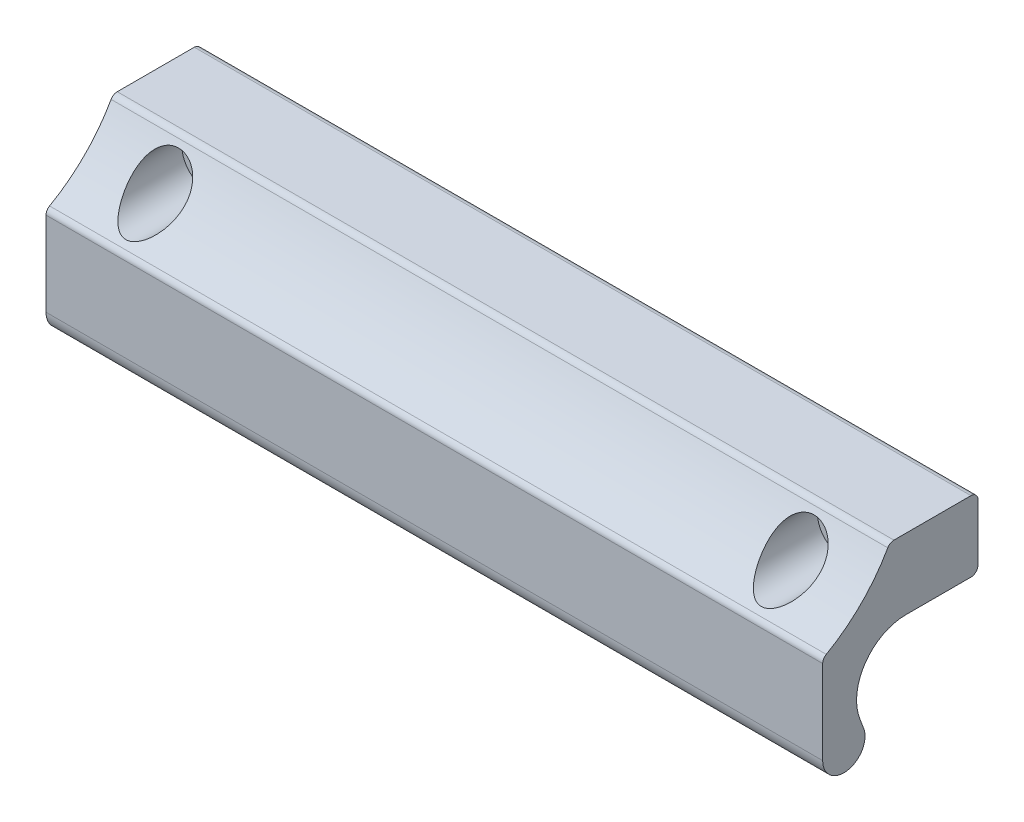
ISO-10303-21;
HEADER;
FILE_DESCRIPTION(('STEP AP214'),'2;1');
FILE_NAME('part.step','',(''),(''),'','','');
FILE_SCHEMA(('AUTOMOTIVE_DESIGN { 1 0 10303 214 1 1 1 1 }'));
ENDSEC;
DATA;
#1=APPLICATION_CONTEXT('core data for automotive mechanical design processes');
#2=APPLICATION_PROTOCOL_DEFINITION('international standard','automotive_design',2000,#1);
#3=PRODUCT_CONTEXT('',#1,'mechanical');
#4=PRODUCT('Part','Part','',(#3));
#5=PRODUCT_RELATED_PRODUCT_CATEGORY('part','',(#4));
#6=PRODUCT_DEFINITION_FORMATION('','',#4);
#7=PRODUCT_DEFINITION_CONTEXT('part definition',#1,'design');
#8=PRODUCT_DEFINITION('design','',#6,#7);
#9=PRODUCT_DEFINITION_SHAPE('','',#8);
#10=(LENGTH_UNIT() NAMED_UNIT(*) SI_UNIT(.MILLI.,.METRE.));
#11=(NAMED_UNIT(*) PLANE_ANGLE_UNIT() SI_UNIT($,.RADIAN.));
#12=(NAMED_UNIT(*) SI_UNIT($,.STERADIAN.) SOLID_ANGLE_UNIT());
#13=UNCERTAINTY_MEASURE_WITH_UNIT(LENGTH_MEASURE(1.E-05),#10,'distance_accuracy_value','');
#14=(GEOMETRIC_REPRESENTATION_CONTEXT(3) GLOBAL_UNCERTAINTY_ASSIGNED_CONTEXT((#13)) GLOBAL_UNIT_ASSIGNED_CONTEXT((#10,
#11,#12)) REPRESENTATION_CONTEXT('',''));
#15=CARTESIAN_POINT('',(0.,0.,0.));
#16=DIRECTION('',(0.,0.,1.));
#17=DIRECTION('',(1.,0.,0.));
#18=AXIS2_PLACEMENT_3D('',#15,#16,#17);
#19=CARTESIAN_POINT('',(-10.,15.8043402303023,32.8043402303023));
#20=DIRECTION('',(1.,0.,0.));
#21=DIRECTION('',(0.,1.,0.));
#22=AXIS2_PLACEMENT_3D('',#19,#20,#21);
#23=CYLINDRICAL_SURFACE('',#22,23.);
#24=CARTESIAN_POINT('',(93.75,0.,16.094378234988));
#25=CARTESIAN_POINT('',(93.7500006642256,-0.150169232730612,16.236409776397));
#26=CARTESIAN_POINT('',(93.7409857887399,-0.29845859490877,16.3805076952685));
#27=CARTESIAN_POINT('',(93.7061827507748,-0.590181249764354,16.6716960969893));
#28=CARTESIAN_POINT('',(93.6803814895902,-0.733610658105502,16.8187888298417));
#29=CARTESIAN_POINT('',(93.6128217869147,-1.01544237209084,17.1155863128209));
#30=CARTESIAN_POINT('',(93.5709823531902,-1.15381519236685,17.2653005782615));
#31=CARTESIAN_POINT('',(93.4720695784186,-1.42405592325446,17.5654707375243));
#32=CARTESIAN_POINT('',(93.4150003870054,-1.55592559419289,17.7159264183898));
#33=CARTESIAN_POINT('',(93.2849647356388,-1.81460439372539,18.0187712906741));
#34=CARTESIAN_POINT('',(93.2117670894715,-1.9413043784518,18.1711545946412));
#35=CARTESIAN_POINT('',(93.0498715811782,-2.1868769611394,18.4741574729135));
#36=CARTESIAN_POINT('',(92.9611662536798,-2.30574575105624,18.6247761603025));
#37=CARTESIAN_POINT('',(92.7681376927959,-2.53420019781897,18.9215160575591));
#38=CARTESIAN_POINT('',(92.6638971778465,-2.64383047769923,19.067656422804));
#39=CARTESIAN_POINT('',(92.4382918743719,-2.853229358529,19.3534526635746));
#40=CARTESIAN_POINT('',(92.316948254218,-2.95300989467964,19.493116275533));
#41=CARTESIAN_POINT('',(92.0789502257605,-3.12374564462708,19.7373761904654));
#42=CARTESIAN_POINT('',(91.965498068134,-3.19663498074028,19.8437139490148));
#43=CARTESIAN_POINT('',(91.7241156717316,-3.33304729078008,20.045999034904));
#44=CARTESIAN_POINT('',(91.5961684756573,-3.39655909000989,20.1419339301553));
#45=CARTESIAN_POINT('',(91.3222714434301,-3.51232726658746,20.3192407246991));
#46=CARTESIAN_POINT('',(91.1760841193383,-3.56440400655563,20.4003772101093));
#47=CARTESIAN_POINT('',(90.9451529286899,-3.62981593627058,20.5033135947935));
#48=CARTESIAN_POINT('',(90.8663403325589,-3.64948596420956,20.5344702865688));
#49=CARTESIAN_POINT('',(90.7051956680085,-3.68401760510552,20.5893923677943));
#50=CARTESIAN_POINT('',(90.6228662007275,-3.69888270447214,20.6131631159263));
#51=CARTESIAN_POINT('',(90.4293848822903,-3.72697994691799,20.658210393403));
#52=CARTESIAN_POINT('',(90.3172035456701,-3.73828046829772,20.6764343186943));
#53=CARTESIAN_POINT('',(90.0908651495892,-3.75060996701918,20.6963234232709));
#54=CARTESIAN_POINT('',(89.9767093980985,-3.75164550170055,20.6979991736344));
#55=CARTESIAN_POINT('',(89.7498794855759,-3.74336926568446,20.6846411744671));
#56=CARTESIAN_POINT('',(89.6372042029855,-3.73406584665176,20.669620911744));
#57=CARTESIAN_POINT('',(89.4161596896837,-3.70595298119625,20.6244737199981));
#58=CARTESIAN_POINT('',(89.307794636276,-3.68713454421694,20.5943325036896));
#59=CARTESIAN_POINT('',(89.0562251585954,-3.6323825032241,20.5072938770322));
#60=CARTESIAN_POINT('',(88.9158969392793,-3.59263719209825,20.4445472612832));
#61=CARTESIAN_POINT('',(88.6486494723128,-3.50092089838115,20.3017774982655));
#62=CARTESIAN_POINT('',(88.5217650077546,-3.44891927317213,20.2217110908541));
#63=CARTESIAN_POINT('',(88.303724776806,-3.34616134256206,20.0659999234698));
#64=CARTESIAN_POINT('',(88.2103375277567,-3.29701024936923,19.9923557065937));
#65=CARTESIAN_POINT('',(88.0314834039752,-3.19345122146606,19.8392926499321));
#66=CARTESIAN_POINT('',(87.946021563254,-3.13903998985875,19.7598701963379));
#67=CARTESIAN_POINT('',(87.7823320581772,-3.0256203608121,19.5966727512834));
#68=CARTESIAN_POINT('',(87.704116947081,-2.96660430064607,19.5128905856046));
#69=CARTESIAN_POINT('',(87.554530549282,-2.84455534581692,19.3421814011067));
#70=CARTESIAN_POINT('',(87.4831614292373,-2.7815211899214,19.255253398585));
#71=CARTESIAN_POINT('',(87.3069800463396,-2.61388606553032,19.0275868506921));
#72=CARTESIAN_POINT('',(87.2070155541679,-2.50653247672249,18.8851063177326));
#73=CARTESIAN_POINT('',(87.022064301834,-2.28371602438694,18.5967547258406));
#74=CARTESIAN_POINT('',(86.9370856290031,-2.16824882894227,18.4508818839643));
#75=CARTESIAN_POINT('',(86.7815301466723,-1.92982538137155,18.1573214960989));
#76=CARTESIAN_POINT('',(86.710967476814,-1.80686192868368,18.0096323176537));
#77=CARTESIAN_POINT('',(86.5842889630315,-1.55415187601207,17.7139267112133));
#78=CARTESIAN_POINT('',(86.5281703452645,-1.42440658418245,17.565910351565));
#79=CARTESIAN_POINT('',(86.4294697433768,-1.15535678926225,17.2669625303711));
#80=CARTESIAN_POINT('',(86.3872582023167,-1.01589497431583,17.116049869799));
#81=CARTESIAN_POINT('',(86.3190319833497,-0.73104439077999,16.8160994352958));
#82=CARTESIAN_POINT('',(86.293019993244,-0.5856546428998,16.667061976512));
#83=CARTESIAN_POINT('',(86.25828003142,-0.290055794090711,16.3722410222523));
#84=CARTESIAN_POINT('',(86.2495221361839,-0.139855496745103,16.2264523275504));
#85=CARTESIAN_POINT('',(86.2505179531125,0.164377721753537,15.9391279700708));
#86=CARTESIAN_POINT('',(86.2602636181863,0.318408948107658,15.7975904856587));
#87=CARTESIAN_POINT('',(86.3079126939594,0.692581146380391,15.4630412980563));
#88=CARTESIAN_POINT('',(86.3557102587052,0.913971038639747,15.2726783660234));
#89=CARTESIAN_POINT('',(86.495799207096,1.35518812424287,14.9073062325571));
#90=CARTESIAN_POINT('',(86.588026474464,1.57501710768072,14.7322753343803));
#91=CARTESIAN_POINT('',(86.7991197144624,1.9636736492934,14.4335970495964));
#92=CARTESIAN_POINT('',(86.909662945,2.13429131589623,14.3064889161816));
#93=CARTESIAN_POINT('',(87.1001727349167,2.3799745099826,14.1282393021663));
#94=CARTESIAN_POINT('',(87.1678322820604,2.46019965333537,14.0708656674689));
#95=CARTESIAN_POINT('',(87.3113580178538,2.61628143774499,13.9606622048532));
#96=CARTESIAN_POINT('',(87.3872204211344,2.69214006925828,13.907830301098));
#97=CARTESIAN_POINT('',(87.5477452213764,2.83917333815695,13.806643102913));
#98=CARTESIAN_POINT('',(87.6324832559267,2.91029755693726,13.758334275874));
#99=CARTESIAN_POINT('',(87.8097619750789,3.04594886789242,13.6672003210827));
#100=CARTESIAN_POINT('',(87.902298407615,3.11047951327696,13.6243722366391));
#101=CARTESIAN_POINT('',(88.0946077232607,3.23185755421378,13.5445905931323));
#102=CARTESIAN_POINT('',(88.1943773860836,3.28870833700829,13.5076344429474));
#103=CARTESIAN_POINT('',(88.4004020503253,3.39369189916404,13.4399472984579));
#104=CARTESIAN_POINT('',(88.5066557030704,3.44182648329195,13.4092150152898));
#105=CARTESIAN_POINT('',(88.7083226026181,3.52193401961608,13.3584049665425));
#106=CARTESIAN_POINT('',(88.8029778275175,3.55524764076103,13.3374209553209));
#107=CARTESIAN_POINT('',(88.9955300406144,3.61437106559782,13.3003439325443));
#108=CARTESIAN_POINT('',(89.0934265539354,3.64018196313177,13.2842502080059));
#109=CARTESIAN_POINT('',(89.2915997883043,3.68387839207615,13.2570880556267));
#110=CARTESIAN_POINT('',(89.3918751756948,3.70176825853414,13.2460168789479));
#111=CARTESIAN_POINT('',(89.5939747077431,3.72934871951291,13.2289770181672));
#112=CARTESIAN_POINT('',(89.6957987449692,3.73903988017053,13.2230079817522));
#113=CARTESIAN_POINT('',(89.8896006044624,3.74949905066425,13.2165676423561));
#114=CARTESIAN_POINT('',(89.9815192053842,3.751079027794,13.2155960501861));
#115=CARTESIAN_POINT('',(90.1652063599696,3.7474856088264,13.2178075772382));
#116=CARTESIAN_POINT('',(90.2569748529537,3.74230994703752,13.2209920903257));
#117=CARTESIAN_POINT('',(90.4395972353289,3.72527248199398,13.2314961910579));
#118=CARTESIAN_POINT('',(90.5304516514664,3.71341478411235,13.2388132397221));
#119=CARTESIAN_POINT('',(90.7106535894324,3.68318293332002,13.2575283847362));
#120=CARTESIAN_POINT('',(90.8000005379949,3.66480635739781,13.2689279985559));
#121=CARTESIAN_POINT('',(91.0615737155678,3.60101108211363,13.3086664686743));
#122=CARTESIAN_POINT('',(91.2308516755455,3.54658365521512,13.3427515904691));
#123=CARTESIAN_POINT('',(91.5568664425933,3.41607587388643,13.4255677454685));
#124=CARTESIAN_POINT('',(91.7136012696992,3.33999210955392,13.4743010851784));
#125=CARTESIAN_POINT('',(92.0192314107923,3.1650856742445,13.5881842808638));
#126=CARTESIAN_POINT('',(92.1672994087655,3.06528886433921,13.6540540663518));
#127=CARTESIAN_POINT('',(92.443829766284,2.84973334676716,13.7992083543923));
#128=CARTESIAN_POINT('',(92.5722875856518,2.73397095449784,13.8784959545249));
#129=CARTESIAN_POINT('',(92.8221710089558,2.47661423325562,14.0586987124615));
#130=CARTESIAN_POINT('',(92.9410681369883,2.33358067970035,14.1610543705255));
#131=CARTESIAN_POINT('',(93.1530779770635,2.03807613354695,14.3781704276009));
#132=CARTESIAN_POINT('',(93.2461621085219,1.88559490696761,14.4929443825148));
#133=CARTESIAN_POINT('',(93.4441188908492,1.50504726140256,14.7873723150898));
#134=CARTESIAN_POINT('',(93.5350714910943,1.27416834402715,14.9727785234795));
#135=CARTESIAN_POINT('',(93.668890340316,0.812200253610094,15.3593785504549));
#136=CARTESIAN_POINT('',(93.7117581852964,0.581111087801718,15.5605718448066));
#137=CARTESIAN_POINT('',(93.7389347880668,0.293978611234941,15.8209607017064));
#138=CARTESIAN_POINT('',(93.7431071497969,0.234797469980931,15.8751995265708));
#139=CARTESIAN_POINT('',(93.7486383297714,0.116983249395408,15.9843147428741));
#140=CARTESIAN_POINT('',(93.7499997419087,0.0583497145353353,16.0391904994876));
#141=CARTESIAN_POINT('',(93.75,0.,16.094378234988));
#142=B_SPLINE_CURVE_WITH_KNOTS('',3,(#24,#25,#26,#27,#28,#29,#30,#31,#32,#33,#34,#35,#36,#37,
#38,#39,#40,#41,#42,#43,#44,#45,#46,#47,#48,#49,#50,#51,#52,#53,#54,#55,#56,#57,#58,#59,#60,#61,
#62,#63,#64,#65,#66,#67,#68,#69,#70,#71,#72,#73,#74,#75,#76,#77,#78,#79,#80,#81,#82,#83,#84,#85,
#86,#87,#88,#89,#90,#91,#92,#93,#94,#95,#96,#97,#98,#99,#100,#101,#102,#103,#104,#105,#106,#107,
#108,#109,#110,#111,#112,#113,#114,#115,#116,#117,#118,#119,#120,#121,#122,#123,#124,#125,#126,
#127,#128,#129,#130,#131,#132,#133,#134,#135,#136,#137,#138,#139,#140,#141),.UNSPECIFIED.,.T.,
.F.,(4,2,2,2,2,2,2,2,2,2,2,2,2,2,2,2,2,2,2,2,2,2,2,2,2,2,2,2,2,2,2,2,2,2,2,2,2,2,2,2,2,2,2,2,2,
2,2,2,2,2,2,2,2,2,2,2,2,2,4),(0.,0.620002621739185,1.24048962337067,1.8641522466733,
2.48764511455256,3.12073548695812,3.75413147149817,4.38426801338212,5.01363137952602,
5.52787354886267,6.04272365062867,6.5651600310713,6.82572511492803,7.08610070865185,
7.4271175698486,7.76791657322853,8.10844048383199,8.44928675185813,8.92293422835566,
9.39777869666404,9.78331644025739,10.1690974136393,10.5555346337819,10.9420937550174,
11.5546950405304,12.1676259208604,12.7811551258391,13.3945664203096,14.0231985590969,
14.6519349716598,15.2795800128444,15.9069521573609,16.7911651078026,17.6741058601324,
18.3902630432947,18.7487042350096,19.1069807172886,19.4686065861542,19.8300365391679,
20.1913065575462,20.5525016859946,20.859631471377,21.166716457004,21.4736331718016,
21.7805286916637,22.056004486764,22.3315726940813,22.606971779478,22.8824733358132,
23.422984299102,23.9635804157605,24.532194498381,25.100940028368,25.7354158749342,
26.370591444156,27.2948858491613,28.2191495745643,28.4602802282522,28.7011882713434),.UNSPECIFIED.);
#143=CARTESIAN_POINT('',(93.75,0.,16.094378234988));
#144=VERTEX_POINT('',#143);
#145=EDGE_CURVE('E18',#144,#144,#142,.T.);
#146=ORIENTED_EDGE('',*,*,#145,.T.);
#147=EDGE_LOOP('',(#146));
#148=FACE_BOUND('',#147,.T.);
#149=CARTESIAN_POINT('',(3.75,0.,16.094378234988));
#150=CARTESIAN_POINT('',(3.75000066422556,-0.150169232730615,16.236409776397));
#151=CARTESIAN_POINT('',(3.74098578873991,-0.298458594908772,16.3805076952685));
#152=CARTESIAN_POINT('',(3.70618275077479,-0.590181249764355,16.6716960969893));
#153=CARTESIAN_POINT('',(3.68038148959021,-0.7336106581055,16.8187888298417));
#154=CARTESIAN_POINT('',(3.61282178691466,-1.01544237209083,17.1155863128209));
#155=CARTESIAN_POINT('',(3.57098235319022,-1.15381519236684,17.2653005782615));
#156=CARTESIAN_POINT('',(3.47206957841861,-1.42405592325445,17.5654707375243));
#157=CARTESIAN_POINT('',(3.41500038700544,-1.55592559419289,17.7159264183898));
#158=CARTESIAN_POINT('',(3.28496473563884,-1.81460439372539,18.0187712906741));
#159=CARTESIAN_POINT('',(3.21176708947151,-1.9413043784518,18.1711545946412));
#160=CARTESIAN_POINT('',(3.04987158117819,-2.1868769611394,18.4741574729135));
#161=CARTESIAN_POINT('',(2.96116625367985,-2.30574575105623,18.6247761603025));
#162=CARTESIAN_POINT('',(2.76813769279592,-2.53420019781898,18.9215160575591));
#163=CARTESIAN_POINT('',(2.66389717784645,-2.64383047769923,19.067656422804));
#164=CARTESIAN_POINT('',(2.43829187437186,-2.853229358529,19.3534526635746));
#165=CARTESIAN_POINT('',(2.31694825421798,-2.95300989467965,19.493116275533));
#166=CARTESIAN_POINT('',(2.07895022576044,-3.12374564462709,19.7373761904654));
#167=CARTESIAN_POINT('',(1.965498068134,-3.19663498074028,19.8437139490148));
#168=CARTESIAN_POINT('',(1.72411567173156,-3.33304729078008,20.045999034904));
#169=CARTESIAN_POINT('',(1.59616847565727,-3.3965590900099,20.1419339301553));
#170=CARTESIAN_POINT('',(1.3222714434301,-3.51232726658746,20.3192407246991));
#171=CARTESIAN_POINT('',(1.17608411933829,-3.56440400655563,20.4003772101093));
#172=CARTESIAN_POINT('',(0.94515292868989,-3.62981593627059,20.5033135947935));
#173=CARTESIAN_POINT('',(0.866340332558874,-3.64948596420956,20.5344702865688));
#174=CARTESIAN_POINT('',(0.705195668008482,-3.68401760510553,20.5893923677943));
#175=CARTESIAN_POINT('',(0.622866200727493,-3.69888270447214,20.6131631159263));
#176=CARTESIAN_POINT('',(0.429384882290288,-3.72697994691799,20.658210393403));
#177=CARTESIAN_POINT('',(0.317203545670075,-3.73828046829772,20.6764343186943));
#178=CARTESIAN_POINT('',(0.0908651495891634,-3.75060996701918,20.6963234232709));
#179=CARTESIAN_POINT('',(-0.0232906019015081,-3.75164550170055,20.6979991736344));
#180=CARTESIAN_POINT('',(-0.250120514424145,-3.74336926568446,20.6846411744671));
#181=CARTESIAN_POINT('',(-0.362795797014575,-3.73406584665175,20.669620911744));
#182=CARTESIAN_POINT('',(-0.583840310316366,-3.70595298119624,20.6244737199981));
#183=CARTESIAN_POINT('',(-0.692205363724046,-3.68713454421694,20.5943325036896));
#184=CARTESIAN_POINT('',(-0.943774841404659,-3.63238250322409,20.5072938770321));
#185=CARTESIAN_POINT('',(-1.08410306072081,-3.59263719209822,20.4445472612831));
#186=CARTESIAN_POINT('',(-1.35135052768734,-3.50092089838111,20.3017774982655));
#187=CARTESIAN_POINT('',(-1.4782349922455,-3.44891927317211,20.221711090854));
#188=CARTESIAN_POINT('',(-1.69627522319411,-3.34616134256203,20.0659999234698));
#189=CARTESIAN_POINT('',(-1.78966247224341,-3.29701024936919,19.9923557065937));
#190=CARTESIAN_POINT('',(-1.9685165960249,-3.19345122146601,19.839292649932));
#191=CARTESIAN_POINT('',(-2.0539784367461,-3.13903998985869,19.7598701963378));
#192=CARTESIAN_POINT('',(-2.2176679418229,-3.02562036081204,19.5966727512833));
#193=CARTESIAN_POINT('',(-2.29588305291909,-2.96660430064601,19.5128905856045));
#194=CARTESIAN_POINT('',(-2.44546945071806,-2.84455534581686,19.3421814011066));
#195=CARTESIAN_POINT('',(-2.51683857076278,-2.78152118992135,19.255253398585));
#196=CARTESIAN_POINT('',(-2.69301995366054,-2.61388606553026,19.0275868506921));
#197=CARTESIAN_POINT('',(-2.79298444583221,-2.50653247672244,18.8851063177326));
#198=CARTESIAN_POINT('',(-2.97793569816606,-2.28371602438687,18.5967547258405));
#199=CARTESIAN_POINT('',(-3.06291437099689,-2.1682488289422,18.4508818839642));
#200=CARTESIAN_POINT('',(-3.21846985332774,-1.92982538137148,18.1573214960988));
#201=CARTESIAN_POINT('',(-3.28903252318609,-1.80686192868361,18.0096323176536));
#202=CARTESIAN_POINT('',(-3.41571103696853,-1.55415187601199,17.7139267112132));
#203=CARTESIAN_POINT('',(-3.47182965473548,-1.42440658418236,17.5659103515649));
#204=CARTESIAN_POINT('',(-3.57053025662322,-1.15535678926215,17.266962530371));
#205=CARTESIAN_POINT('',(-3.61274179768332,-1.01589497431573,17.1160498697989));
#206=CARTESIAN_POINT('',(-3.68096801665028,-0.731044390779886,16.8160994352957));
#207=CARTESIAN_POINT('',(-3.70698000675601,-0.585654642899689,16.6670619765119));
#208=CARTESIAN_POINT('',(-3.74171996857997,-0.290055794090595,16.3722410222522));
#209=CARTESIAN_POINT('',(-3.75047786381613,-0.139855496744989,16.2264523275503));
#210=CARTESIAN_POINT('',(-3.74948204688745,0.164377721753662,15.9391279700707));
#211=CARTESIAN_POINT('',(-3.73973638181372,0.318408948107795,15.7975904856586));
#212=CARTESIAN_POINT('',(-3.69208730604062,0.692581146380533,15.4630412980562));
#213=CARTESIAN_POINT('',(-3.64428974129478,0.913971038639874,15.2726783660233));
#214=CARTESIAN_POINT('',(-3.50420079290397,1.35518812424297,14.907306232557));
#215=CARTESIAN_POINT('',(-3.41197352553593,1.57501710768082,14.7322753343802));
#216=CARTESIAN_POINT('',(-3.20088028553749,1.9636736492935,14.4335970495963));
#217=CARTESIAN_POINT('',(-3.09033705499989,2.13429131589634,14.3064889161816));
#218=CARTESIAN_POINT('',(-2.89982726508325,2.3799745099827,14.1282393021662));
#219=CARTESIAN_POINT('',(-2.83216771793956,2.46019965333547,14.0708656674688));
#220=CARTESIAN_POINT('',(-2.68864198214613,2.61628143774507,13.9606622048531));
#221=CARTESIAN_POINT('',(-2.61277957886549,2.69214006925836,13.9078303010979));
#222=CARTESIAN_POINT('',(-2.45225477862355,2.83917333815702,13.806643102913));
#223=CARTESIAN_POINT('',(-2.36751674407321,2.91029755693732,13.758334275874));
#224=CARTESIAN_POINT('',(-2.19023802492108,3.04594886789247,13.6672003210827));
#225=CARTESIAN_POINT('',(-2.09770159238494,3.11047951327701,13.624372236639));
#226=CARTESIAN_POINT('',(-1.90539227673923,3.23185755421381,13.5445905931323));
#227=CARTESIAN_POINT('',(-1.80562261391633,3.28870833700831,13.5076344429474));
#228=CARTESIAN_POINT('',(-1.59959794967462,3.39369189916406,13.4399472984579));
#229=CARTESIAN_POINT('',(-1.49334429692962,3.44182648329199,13.4092150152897));
#230=CARTESIAN_POINT('',(-1.29167739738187,3.52193401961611,13.3584049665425));
#231=CARTESIAN_POINT('',(-1.19702217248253,3.55524764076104,13.3374209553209));
#232=CARTESIAN_POINT('',(-1.00446995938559,3.61437106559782,13.3003439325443));
#233=CARTESIAN_POINT('',(-0.906573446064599,3.64018196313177,13.2842502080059));
#234=CARTESIAN_POINT('',(-0.708400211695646,3.68387839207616,13.2570880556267));
#235=CARTESIAN_POINT('',(-0.608124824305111,3.70176825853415,13.2460168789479));
#236=CARTESIAN_POINT('',(-0.406025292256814,3.72934871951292,13.2289770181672));
#237=CARTESIAN_POINT('',(-0.304201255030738,3.73903988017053,13.2230079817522));
#238=CARTESIAN_POINT('',(-0.110399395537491,3.74949905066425,13.2165676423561));
#239=CARTESIAN_POINT('',(-0.0184807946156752,3.751079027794,13.2155960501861));
#240=CARTESIAN_POINT('',(0.165206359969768,3.7474856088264,13.2178075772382));
#241=CARTESIAN_POINT('',(0.256974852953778,3.74230994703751,13.2209920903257));
#242=CARTESIAN_POINT('',(0.439597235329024,3.72527248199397,13.2314961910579));
#243=CARTESIAN_POINT('',(0.530451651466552,3.71341478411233,13.2388132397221));
#244=CARTESIAN_POINT('',(0.710653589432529,3.68318293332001,13.2575283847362));
#245=CARTESIAN_POINT('',(0.800000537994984,3.66480635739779,13.2689279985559));
#246=CARTESIAN_POINT('',(1.06157371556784,3.60101108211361,13.3086664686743));
#247=CARTESIAN_POINT('',(1.23085167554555,3.54658365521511,13.3427515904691));
#248=CARTESIAN_POINT('',(1.55686644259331,3.4160758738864,13.4255677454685));
#249=CARTESIAN_POINT('',(1.71360126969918,3.33999210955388,13.4743010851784));
#250=CARTESIAN_POINT('',(2.01923141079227,3.16508567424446,13.5881842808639));
#251=CARTESIAN_POINT('',(2.1672994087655,3.06528886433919,13.6540540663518));
#252=CARTESIAN_POINT('',(2.44382976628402,2.84973334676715,13.7992083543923));
#253=CARTESIAN_POINT('',(2.5722875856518,2.7339709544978,13.878495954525));
#254=CARTESIAN_POINT('',(2.82217100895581,2.47661423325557,14.0586987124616));
#255=CARTESIAN_POINT('',(2.94106813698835,2.3335806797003,14.1610543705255));
#256=CARTESIAN_POINT('',(3.15307797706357,2.03807613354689,14.378170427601));
#257=CARTESIAN_POINT('',(3.24616210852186,1.88559490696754,14.4929443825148));
#258=CARTESIAN_POINT('',(3.44411889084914,1.50504726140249,14.7873723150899));
#259=CARTESIAN_POINT('',(3.53507149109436,1.27416834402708,14.9727785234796));
#260=CARTESIAN_POINT('',(3.66889034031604,0.812200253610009,15.3593785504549));
#261=CARTESIAN_POINT('',(3.71175818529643,0.581111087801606,15.5605718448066));
#262=CARTESIAN_POINT('',(3.73893478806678,0.293978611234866,15.8209607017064));
#263=CARTESIAN_POINT('',(3.74310714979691,0.234797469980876,15.8751995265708));
#264=CARTESIAN_POINT('',(3.74863832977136,0.116983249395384,15.9843147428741));
#265=CARTESIAN_POINT('',(3.7499997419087,0.0583497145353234,16.0391904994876));
#266=CARTESIAN_POINT('',(3.75,0.,16.094378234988));
#267=B_SPLINE_CURVE_WITH_KNOTS('',3,(#149,#150,#151,#152,#153,#154,#155,#156,#157,#158,#159,
#160,#161,#162,#163,#164,#165,#166,#167,#168,#169,#170,#171,#172,#173,#174,#175,#176,#177,#178,
#179,#180,#181,#182,#183,#184,#185,#186,#187,#188,#189,#190,#191,#192,#193,#194,#195,#196,#197,
#198,#199,#200,#201,#202,#203,#204,#205,#206,#207,#208,#209,#210,#211,#212,#213,#214,#215,#216,
#217,#218,#219,#220,#221,#222,#223,#224,#225,#226,#227,#228,#229,#230,#231,#232,#233,#234,#235,
#236,#237,#238,#239,#240,#241,#242,#243,#244,#245,#246,#247,#248,#249,#250,#251,#252,#253,#254,
#255,#256,#257,#258,#259,#260,#261,#262,#263,#264,#265,#266),.UNSPECIFIED.,.T.,.F.,(4,2,2,2,2,2,
2,2,2,2,2,2,2,2,2,2,2,2,2,2,2,2,2,2,2,2,2,2,2,2,2,2,2,2,2,2,2,2,2,2,2,2,2,2,2,2,2,2,2,2,2,2,2,2,
2,2,2,2,4),(0.,0.620002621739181,1.24048962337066,1.8641522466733,2.48764511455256,
3.12073548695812,3.75413147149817,4.38426801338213,5.01363137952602,5.52787354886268,
6.04272365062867,6.5651600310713,6.82572511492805,7.08610070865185,7.42711756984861,
7.76791657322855,8.10844048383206,8.44928675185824,8.92293422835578,9.39777869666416,
9.78331644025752,10.1690974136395,10.555534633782,10.9420937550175,11.5546950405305,
12.1676259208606,12.7811551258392,13.3945664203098,14.0231985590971,14.65193497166,
15.2795800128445,15.9069521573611,16.7911651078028,17.6741058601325,18.3902630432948,
18.7487042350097,19.1069807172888,19.4686065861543,19.830036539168,20.1913065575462,
20.5525016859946,20.859631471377,21.1667164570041,21.4736331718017,21.7805286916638,
22.0560044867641,22.3315726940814,22.6069717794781,22.8824733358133,23.422984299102,
23.9635804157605,24.532194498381,25.1009400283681,25.7354158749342,26.3705914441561,
27.2948858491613,28.2191495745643,28.4602802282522,28.7011882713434),.UNSPECIFIED.);
#268=CARTESIAN_POINT('',(3.75,0.,16.094378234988));
#269=VERTEX_POINT('',#268);
#270=EDGE_CURVE('E131',#269,#269,#267,.T.);
#271=ORIENTED_EDGE('',*,*,#270,.T.);
#272=EDGE_LOOP('',(#271));
#273=FACE_BOUND('',#272,.T.);
#274=DIRECTION('',(1.,0.,0.));
#275=VECTOR('',#274,1.);
#276=CARTESIAN_POINT('',(-10.,-4.22133100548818,21.4918475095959));
#277=LINE('',#276,#275);
#278=CARTESIAN_POINT('',(-10.,-4.22133100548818,21.4918475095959));
#279=VERTEX_POINT('',#278);
#280=CARTESIAN_POINT('',(100.,-4.22133100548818,21.4918475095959));
#281=VERTEX_POINT('',#280);
#282=EDGE_CURVE('E127',#279,#281,#277,.T.);
#283=ORIENTED_EDGE('',*,*,#282,.T.);
#284=CARTESIAN_POINT('',(100.,15.8043402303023,32.8043402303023));
#285=DIRECTION('',(1.,0.,0.));
#286=DIRECTION('',(0.,-1.,0.));
#287=AXIS2_PLACEMENT_3D('',#284,#285,#286);
#288=CIRCLE('',#287,23.);
#289=CARTESIAN_POINT('',(100.,4.49184750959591,12.7786689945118));
#290=VERTEX_POINT('',#289);
#291=EDGE_CURVE('E121',#281,#290,#288,.T.);
#292=ORIENTED_EDGE('',*,*,#291,.T.);
#293=DIRECTION('',(1.,0.,0.));
#294=VECTOR('',#293,1.);
#295=CARTESIAN_POINT('',(-10.,4.49184750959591,12.7786689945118));
#296=LINE('',#295,#294);
#297=CARTESIAN_POINT('',(-10.,4.49184750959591,12.7786689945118));
#298=VERTEX_POINT('',#297);
#299=EDGE_CURVE('E9',#298,#290,#296,.T.);
#300=ORIENTED_EDGE('',*,*,#299,.F.);
#301=CARTESIAN_POINT('',(-10.,15.8043402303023,32.8043402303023));
#302=DIRECTION('',(1.,0.,0.));
#303=DIRECTION('',(0.,-1.,0.));
#304=AXIS2_PLACEMENT_3D('',#301,#302,#303);
#305=CIRCLE('',#304,23.);
#306=EDGE_CURVE('E162',#279,#298,#305,.T.);
#307=ORIENTED_EDGE('',*,*,#306,.F.);
#308=EDGE_LOOP('',(#283,#292,#300,#307));
#309=FACE_BOUND('',#308,.T.);
#310=ADVANCED_FACE('F14',(#148,#273,#309),#23,.F.);
#311=CARTESIAN_POINT('',(-10.,4.,11.907987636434));
#312=DIRECTION('',(1.,0.,0.));
#313=DIRECTION('',(0.,1.,0.));
#314=AXIS2_PLACEMENT_3D('',#311,#312,#313);
#315=CYLINDRICAL_SURFACE('',#314,1.);
#316=ORIENTED_EDGE('',*,*,#299,.T.);
#317=CARTESIAN_POINT('',(100.,4.,11.907987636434));
#318=DIRECTION('',(-1.,0.,0.));
#319=DIRECTION('',(0.,-1.,0.));
#320=AXIS2_PLACEMENT_3D('',#317,#318,#319);
#321=CIRCLE('',#320,1.);
#322=CARTESIAN_POINT('',(100.,5.,11.907987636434));
#323=VERTEX_POINT('',#322);
#324=EDGE_CURVE('E111',#290,#323,#321,.T.);
#325=ORIENTED_EDGE('',*,*,#324,.T.);
#326=DIRECTION('',(1.,0.,0.));
#327=VECTOR('',#326,1.);
#328=CARTESIAN_POINT('',(-10.,5.,11.907987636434));
#329=LINE('',#328,#327);
#330=CARTESIAN_POINT('',(-10.,5.,11.907987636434));
#331=VERTEX_POINT('',#330);
#332=EDGE_CURVE('E27',#331,#323,#329,.T.);
#333=ORIENTED_EDGE('',*,*,#332,.F.);
#334=CARTESIAN_POINT('',(-10.,4.,11.907987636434));
#335=DIRECTION('',(-1.,0.,0.));
#336=DIRECTION('',(0.,-1.,0.));
#337=AXIS2_PLACEMENT_3D('',#334,#335,#336);
#338=CIRCLE('',#337,1.);
#339=EDGE_CURVE('E112',#298,#331,#338,.T.);
#340=ORIENTED_EDGE('',*,*,#339,.F.);
#341=EDGE_LOOP('',(#316,#325,#333,#340));
#342=FACE_BOUND('',#341,.T.);
#343=ADVANCED_FACE('F109',(#342),#315,.T.);
#344=CARTESIAN_POINT('',(-10.,5.,11.907987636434));
#345=DIRECTION('',(0.,-1.,0.));
#346=DIRECTION('',(1.,0.,0.));
#347=AXIS2_PLACEMENT_3D('',#344,#345,#346);
#348=PLANE('',#347);
#349=ORIENTED_EDGE('',*,*,#332,.T.);
#350=DIRECTION('',(0.,0.,-1.));
#351=VECTOR('',#350,1.);
#352=CARTESIAN_POINT('',(100.,5.,11.907987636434));
#353=LINE('',#352,#351);
#354=CARTESIAN_POINT('',(100.,5.,1.));
#355=VERTEX_POINT('',#354);
#356=EDGE_CURVE('E125',#323,#355,#353,.T.);
#357=ORIENTED_EDGE('',*,*,#356,.T.);
#358=DIRECTION('',(1.,0.,0.));
#359=VECTOR('',#358,1.);
#360=CARTESIAN_POINT('',(-10.,5.,1.));
#361=LINE('',#360,#359);
#362=CARTESIAN_POINT('',(-10.,5.,1.));
#363=VERTEX_POINT('',#362);
#364=EDGE_CURVE('E200',#363,#355,#361,.T.);
#365=ORIENTED_EDGE('',*,*,#364,.F.);
#366=DIRECTION('',(0.,0.,-1.));
#367=VECTOR('',#366,1.);
#368=CARTESIAN_POINT('',(-10.,5.,11.907987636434));
#369=LINE('',#368,#367);
#370=EDGE_CURVE('E165',#331,#363,#369,.T.);
#371=ORIENTED_EDGE('',*,*,#370,.F.);
#372=EDGE_LOOP('',(#349,#357,#365,#371));
#373=FACE_BOUND('',#372,.T.);
#374=ADVANCED_FACE('F265',(#373),#348,.F.);
#375=CARTESIAN_POINT('',(-10.,4.,1.));
#376=DIRECTION('',(1.,0.,0.));
#377=DIRECTION('',(0.,1.,0.));
#378=AXIS2_PLACEMENT_3D('',#375,#376,#377);
#379=CYLINDRICAL_SURFACE('',#378,1.);
#380=ORIENTED_EDGE('',*,*,#364,.T.);
#381=CARTESIAN_POINT('',(100.,4.,1.));
#382=DIRECTION('',(-1.,0.,0.));
#383=DIRECTION('',(0.,-1.,0.));
#384=AXIS2_PLACEMENT_3D('',#381,#382,#383);
#385=CIRCLE('',#384,1.);
#386=CARTESIAN_POINT('',(100.,4.,0.));
#387=VERTEX_POINT('',#386);
#388=EDGE_CURVE('E136',#355,#387,#385,.T.);
#389=ORIENTED_EDGE('',*,*,#388,.T.);
#390=DIRECTION('',(1.,0.,0.));
#391=VECTOR('',#390,1.);
#392=CARTESIAN_POINT('',(-10.,4.,0.));
#393=LINE('',#392,#391);
#394=CARTESIAN_POINT('',(-10.,4.,0.));
#395=VERTEX_POINT('',#394);
#396=EDGE_CURVE('E198',#395,#387,#393,.T.);
#397=ORIENTED_EDGE('',*,*,#396,.F.);
#398=CARTESIAN_POINT('',(-10.,4.,1.));
#399=DIRECTION('',(-1.,0.,0.));
#400=DIRECTION('',(0.,-1.,0.));
#401=AXIS2_PLACEMENT_3D('',#398,#399,#400);
#402=CIRCLE('',#401,1.);
#403=EDGE_CURVE('E167',#363,#395,#402,.T.);
#404=ORIENTED_EDGE('',*,*,#403,.F.);
#405=EDGE_LOOP('',(#380,#389,#397,#404));
#406=FACE_BOUND('',#405,.T.);
#407=ADVANCED_FACE('F261',(#406),#379,.T.);
#408=CARTESIAN_POINT('',(-10.,4.,0.));
#409=DIRECTION('',(0.,0.,1.));
#410=DIRECTION('',(-1.,0.,0.));
#411=AXIS2_PLACEMENT_3D('',#408,#409,#410);
#412=PLANE('',#411);
#413=CARTESIAN_POINT('',(90.,0.,0.));
#414=DIRECTION('',(0.,0.,-1.));
#415=DIRECTION('',(1.,0.,0.));
#416=AXIS2_PLACEMENT_3D('',#413,#414,#415);
#417=CIRCLE('',#416,2.25);
#418=CARTESIAN_POINT('',(92.25,0.,0.));
#419=VERTEX_POINT('',#418);
#420=EDGE_CURVE('E285',#419,#419,#417,.T.);
#421=ORIENTED_EDGE('',*,*,#420,.F.);
#422=EDGE_LOOP('',(#421));
#423=FACE_BOUND('',#422,.T.);
#424=CARTESIAN_POINT('',(0.,0.,0.));
#425=DIRECTION('',(0.,0.,-1.));
#426=DIRECTION('',(1.,0.,0.));
#427=AXIS2_PLACEMENT_3D('',#424,#425,#426);
#428=CIRCLE('',#427,2.25);
#429=CARTESIAN_POINT('',(2.25,0.,0.));
#430=VERTEX_POINT('',#429);
#431=EDGE_CURVE('E128',#430,#430,#428,.T.);
#432=ORIENTED_EDGE('',*,*,#431,.F.);
#433=EDGE_LOOP('',(#432));
#434=FACE_BOUND('',#433,.T.);
#435=ORIENTED_EDGE('',*,*,#396,.T.);
#436=DIRECTION('',(0.,-1.,0.));
#437=VECTOR('',#436,1.);
#438=CARTESIAN_POINT('',(100.,4.,0.));
#439=LINE('',#438,#437);
#440=CARTESIAN_POINT('',(100.,-4.,0.));
#441=VERTEX_POINT('',#440);
#442=EDGE_CURVE('E139',#387,#441,#439,.T.);
#443=ORIENTED_EDGE('',*,*,#442,.T.);
#444=DIRECTION('',(1.,0.,0.));
#445=VECTOR('',#444,1.);
#446=CARTESIAN_POINT('',(-10.,-4.,0.));
#447=LINE('',#446,#445);
#448=CARTESIAN_POINT('',(-10.,-4.,0.));
#449=VERTEX_POINT('',#448);
#450=EDGE_CURVE('E196',#449,#441,#447,.T.);
#451=ORIENTED_EDGE('',*,*,#450,.F.);
#452=DIRECTION('',(0.,-1.,0.));
#453=VECTOR('',#452,1.);
#454=CARTESIAN_POINT('',(-10.,4.,0.));
#455=LINE('',#454,#453);
#456=EDGE_CURVE('E169',#395,#449,#455,.T.);
#457=ORIENTED_EDGE('',*,*,#456,.F.);
#458=EDGE_LOOP('',(#435,#443,#451,#457));
#459=FACE_BOUND('',#458,.T.);
#460=ADVANCED_FACE('F257',(#423,#434,#459),#412,.F.);
#461=CARTESIAN_POINT('',(-10.,-4.,1.));
#462=DIRECTION('',(1.,0.,0.));
#463=DIRECTION('',(0.,1.,0.));
#464=AXIS2_PLACEMENT_3D('',#461,#462,#463);
#465=CYLINDRICAL_SURFACE('',#464,1.);
#466=ORIENTED_EDGE('',*,*,#450,.T.);
#467=CARTESIAN_POINT('',(100.,-4.,1.));
#468=DIRECTION('',(-1.,0.,0.));
#469=DIRECTION('',(0.,-1.,0.));
#470=AXIS2_PLACEMENT_3D('',#467,#468,#469);
#471=CIRCLE('',#470,1.);
#472=CARTESIAN_POINT('',(100.,-5.,1.));
#473=VERTEX_POINT('',#472);
#474=EDGE_CURVE('E142',#441,#473,#471,.T.);
#475=ORIENTED_EDGE('',*,*,#474,.T.);
#476=DIRECTION('',(1.,0.,0.));
#477=VECTOR('',#476,1.);
#478=CARTESIAN_POINT('',(-10.,-5.,1.));
#479=LINE('',#478,#477);
#480=CARTESIAN_POINT('',(-10.,-5.,1.));
#481=VERTEX_POINT('',#480);
#482=EDGE_CURVE('E194',#481,#473,#479,.T.);
#483=ORIENTED_EDGE('',*,*,#482,.F.);
#484=CARTESIAN_POINT('',(-10.,-4.,1.));
#485=DIRECTION('',(-1.,0.,0.));
#486=DIRECTION('',(0.,-1.,0.));
#487=AXIS2_PLACEMENT_3D('',#484,#485,#486);
#488=CIRCLE('',#487,1.);
#489=EDGE_CURVE('E171',#449,#481,#488,.T.);
#490=ORIENTED_EDGE('',*,*,#489,.F.);
#491=EDGE_LOOP('',(#466,#475,#483,#490));
#492=FACE_BOUND('',#491,.T.);
#493=ADVANCED_FACE('F253',(#492),#465,.T.);
#494=CARTESIAN_POINT('',(-10.,-5.,1.));
#495=DIRECTION('',(0.,1.,0.));
#496=DIRECTION('',(-1.,0.,0.));
#497=AXIS2_PLACEMENT_3D('',#494,#495,#496);
#498=PLANE('',#497);
#499=ORIENTED_EDGE('',*,*,#482,.T.);
#500=DIRECTION('',(0.,0.,1.));
#501=VECTOR('',#500,1.);
#502=CARTESIAN_POINT('',(100.,-5.,1.));
#503=LINE('',#502,#501);
#504=CARTESIAN_POINT('',(100.,-5.,10.2));
#505=VERTEX_POINT('',#504);
#506=EDGE_CURVE('E145',#473,#505,#503,.T.);
#507=ORIENTED_EDGE('',*,*,#506,.T.);
#508=DIRECTION('',(1.,0.,0.));
#509=VECTOR('',#508,1.);
#510=CARTESIAN_POINT('',(-10.,-5.,10.2));
#511=LINE('',#510,#509);
#512=CARTESIAN_POINT('',(-10.,-5.,10.2));
#513=VERTEX_POINT('',#512);
#514=EDGE_CURVE('E192',#513,#505,#511,.T.);
#515=ORIENTED_EDGE('',*,*,#514,.F.);
#516=DIRECTION('',(0.,0.,1.));
#517=VECTOR('',#516,1.);
#518=CARTESIAN_POINT('',(-10.,-5.,1.));
#519=LINE('',#518,#517);
#520=EDGE_CURVE('E173',#481,#513,#519,.T.);
#521=ORIENTED_EDGE('',*,*,#520,.F.);
#522=EDGE_LOOP('',(#499,#507,#515,#521));
#523=FACE_BOUND('',#522,.T.);
#524=ADVANCED_FACE('F249',(#523),#498,.F.);
#525=CARTESIAN_POINT('',(-10.,-12.,10.2));
#526=DIRECTION('',(1.,0.,0.));
#527=DIRECTION('',(0.,1.,0.));
#528=AXIS2_PLACEMENT_3D('',#525,#526,#527);
#529=CYLINDRICAL_SURFACE('',#528,7.);
#530=ORIENTED_EDGE('',*,*,#514,.T.);
#531=CARTESIAN_POINT('',(100.,-12.,10.2));
#532=DIRECTION('',(1.,0.,0.));
#533=DIRECTION('',(0.,-1.,0.));
#534=AXIS2_PLACEMENT_3D('',#531,#532,#533);
#535=CIRCLE('',#534,7.);
#536=CARTESIAN_POINT('',(100.,-14.4773303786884,16.7469713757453));
#537=VERTEX_POINT('',#536);
#538=EDGE_CURVE('E148',#505,#537,#535,.T.);
#539=ORIENTED_EDGE('',*,*,#538,.T.);
#540=DIRECTION('',(1.,0.,0.));
#541=VECTOR('',#540,1.);
#542=CARTESIAN_POINT('',(-10.,-14.4773303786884,16.7469713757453));
#543=LINE('',#542,#541);
#544=CARTESIAN_POINT('',(-10.,-14.4773303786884,16.7469713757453));
#545=VERTEX_POINT('',#544);
#546=EDGE_CURVE('E190',#545,#537,#543,.T.);
#547=ORIENTED_EDGE('',*,*,#546,.F.);
#548=CARTESIAN_POINT('',(-10.,-12.,10.2));
#549=DIRECTION('',(1.,0.,0.));
#550=DIRECTION('',(0.,-1.,0.));
#551=AXIS2_PLACEMENT_3D('',#548,#549,#550);
#552=CIRCLE('',#551,7.);
#553=EDGE_CURVE('E175',#513,#545,#552,.T.);
#554=ORIENTED_EDGE('',*,*,#553,.F.);
#555=EDGE_LOOP('',(#530,#539,#547,#554));
#556=FACE_BOUND('',#555,.T.);
#557=ADVANCED_FACE('F245',(#556),#529,.F.);
#558=CARTESIAN_POINT('',(-10.,-14.4773303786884,16.7469713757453));
#559=DIRECTION('',(0.,-0.353904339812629,0.935281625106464));
#560=DIRECTION('',(0.,0.935281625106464,0.353904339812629));
#561=AXIS2_PLACEMENT_3D('',#558,#559,#560);
#562=PLANE('',#561);
#563=ORIENTED_EDGE('',*,*,#546,.T.);
#564=DIRECTION('',(0.,-0.935281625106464,-0.353904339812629));
#565=VECTOR('',#564,1.);
#566=CARTESIAN_POINT('',(100.,-14.4773303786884,16.7469713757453));
#567=LINE('',#566,#565);
#568=CARTESIAN_POINT('',(100.,-15.9382869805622,16.1941551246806));
#569=VERTEX_POINT('',#568);
#570=EDGE_CURVE('E151',#537,#569,#567,.T.);
#571=ORIENTED_EDGE('',*,*,#570,.T.);
#572=DIRECTION('',(1.,0.,0.));
#573=VECTOR('',#572,1.);
#574=CARTESIAN_POINT('',(-10.,-15.9382869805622,16.1941551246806));
#575=LINE('',#574,#573);
#576=CARTESIAN_POINT('',(-10.,-15.9382869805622,16.1941551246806));
#577=VERTEX_POINT('',#576);
#578=EDGE_CURVE('E188',#577,#569,#575,.T.);
#579=ORIENTED_EDGE('',*,*,#578,.F.);
#580=DIRECTION('',(0.,-0.935281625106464,-0.353904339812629));
#581=VECTOR('',#580,1.);
#582=CARTESIAN_POINT('',(-10.,-14.4773303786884,16.7469713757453));
#583=LINE('',#582,#581);
#584=EDGE_CURVE('E177',#545,#577,#583,.T.);
#585=ORIENTED_EDGE('',*,*,#584,.F.);
#586=EDGE_LOOP('',(#563,#571,#579,#585));
#587=FACE_BOUND('',#586,.T.);
#588=ADVANCED_FACE('F241',(#587),#562,.F.);
#589=CARTESIAN_POINT('',(-10.,-17.,19.));
#590=DIRECTION('',(1.,0.,0.));
#591=DIRECTION('',(0.,1.,0.));
#592=AXIS2_PLACEMENT_3D('',#589,#590,#591);
#593=CYLINDRICAL_SURFACE('',#592,3.);
#594=ORIENTED_EDGE('',*,*,#578,.T.);
#595=CARTESIAN_POINT('',(100.,-17.,19.));
#596=DIRECTION('',(-1.,0.,0.));
#597=DIRECTION('',(0.,-1.,0.));
#598=AXIS2_PLACEMENT_3D('',#595,#596,#597);
#599=CIRCLE('',#598,3.);
#600=CARTESIAN_POINT('',(100.,-17.,22.));
#601=VERTEX_POINT('',#600);
#602=EDGE_CURVE('E154',#569,#601,#599,.T.);
#603=ORIENTED_EDGE('',*,*,#602,.T.);
#604=DIRECTION('',(1.,0.,0.));
#605=VECTOR('',#604,1.);
#606=CARTESIAN_POINT('',(-10.,-17.,22.));
#607=LINE('',#606,#605);
#608=CARTESIAN_POINT('',(-10.,-17.,22.));
#609=VERTEX_POINT('',#608);
#610=EDGE_CURVE('E186',#609,#601,#607,.T.);
#611=ORIENTED_EDGE('',*,*,#610,.F.);
#612=CARTESIAN_POINT('',(-10.,-17.,19.));
#613=DIRECTION('',(-1.,0.,0.));
#614=DIRECTION('',(0.,-1.,0.));
#615=AXIS2_PLACEMENT_3D('',#612,#613,#614);
#616=CIRCLE('',#615,3.);
#617=EDGE_CURVE('E179',#577,#609,#616,.T.);
#618=ORIENTED_EDGE('',*,*,#617,.F.);
#619=EDGE_LOOP('',(#594,#603,#611,#618));
#620=FACE_BOUND('',#619,.T.);
#621=ADVANCED_FACE('F237',(#620),#593,.T.);
#622=CARTESIAN_POINT('',(-10.,-17.,22.));
#623=DIRECTION('',(0.,0.,-1.));
#624=DIRECTION('',(1.,0.,0.));
#625=AXIS2_PLACEMENT_3D('',#622,#623,#624);
#626=PLANE('',#625);
#627=ORIENTED_EDGE('',*,*,#610,.T.);
#628=DIRECTION('',(0.,1.,0.));
#629=VECTOR('',#628,1.);
#630=CARTESIAN_POINT('',(100.,-17.,22.));
#631=LINE('',#630,#629);
#632=CARTESIAN_POINT('',(100.,-5.09201236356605,22.));
#633=VERTEX_POINT('',#632);
#634=EDGE_CURVE('E157',#601,#633,#631,.T.);
#635=ORIENTED_EDGE('',*,*,#634,.T.);
#636=DIRECTION('',(1.,0.,0.));
#637=VECTOR('',#636,1.);
#638=CARTESIAN_POINT('',(-10.,-5.09201236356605,22.));
#639=LINE('',#638,#637);
#640=CARTESIAN_POINT('',(-10.,-5.09201236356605,22.));
#641=VERTEX_POINT('',#640);
#642=EDGE_CURVE('E184',#641,#633,#639,.T.);
#643=ORIENTED_EDGE('',*,*,#642,.F.);
#644=DIRECTION('',(0.,1.,0.));
#645=VECTOR('',#644,1.);
#646=CARTESIAN_POINT('',(-10.,-17.,22.));
#647=LINE('',#646,#645);
#648=EDGE_CURVE('E40',#609,#641,#647,.T.);
#649=ORIENTED_EDGE('',*,*,#648,.F.);
#650=EDGE_LOOP('',(#627,#635,#643,#649));
#651=FACE_BOUND('',#650,.T.);
#652=ADVANCED_FACE('F233',(#651),#626,.F.);
#653=CARTESIAN_POINT('',(-10.,-5.09201236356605,21.));
#654=DIRECTION('',(1.,0.,0.));
#655=DIRECTION('',(0.,1.,0.));
#656=AXIS2_PLACEMENT_3D('',#653,#654,#655);
#657=CYLINDRICAL_SURFACE('',#656,1.00000000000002);
#658=ORIENTED_EDGE('',*,*,#642,.T.);
#659=CARTESIAN_POINT('',(100.,-5.09201236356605,21.));
#660=DIRECTION('',(-1.,0.,0.));
#661=DIRECTION('',(0.,-1.,0.));
#662=AXIS2_PLACEMENT_3D('',#659,#660,#661);
#663=CIRCLE('',#662,1.00000000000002);
#664=EDGE_CURVE('E160',#633,#281,#663,.T.);
#665=ORIENTED_EDGE('',*,*,#664,.T.);
#666=ORIENTED_EDGE('',*,*,#282,.F.);
#667=CARTESIAN_POINT('',(-10.,-5.09201236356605,21.));
#668=DIRECTION('',(-1.,0.,0.));
#669=DIRECTION('',(0.,-1.,0.));
#670=AXIS2_PLACEMENT_3D('',#667,#668,#669);
#671=CIRCLE('',#670,1.00000000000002);
#672=EDGE_CURVE('E35',#641,#279,#671,.T.);
#673=ORIENTED_EDGE('',*,*,#672,.F.);
#674=EDGE_LOOP('',(#658,#665,#666,#673));
#675=FACE_BOUND('',#674,.T.);
#676=ADVANCED_FACE('F230',(#675),#657,.T.);
#677=CARTESIAN_POINT('',(-10.,15.8043402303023,32.8043402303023));
#678=DIRECTION('',(-1.,0.,0.));
#679=DIRECTION('',(0.,-1.,0.));
#680=AXIS2_PLACEMENT_3D('',#677,#678,#679);
#681=PLANE('',#680);
#682=ORIENTED_EDGE('',*,*,#306,.T.);
#683=ORIENTED_EDGE('',*,*,#339,.T.);
#684=ORIENTED_EDGE('',*,*,#370,.T.);
#685=ORIENTED_EDGE('',*,*,#403,.T.);
#686=ORIENTED_EDGE('',*,*,#456,.T.);
#687=ORIENTED_EDGE('',*,*,#489,.T.);
#688=ORIENTED_EDGE('',*,*,#520,.T.);
#689=ORIENTED_EDGE('',*,*,#553,.T.);
#690=ORIENTED_EDGE('',*,*,#584,.T.);
#691=ORIENTED_EDGE('',*,*,#617,.T.);
#692=ORIENTED_EDGE('',*,*,#648,.T.);
#693=ORIENTED_EDGE('',*,*,#672,.T.);
#694=EDGE_LOOP('',(#682,#683,#684,#685,#686,#687,#688,#689,#690,#691,#692,#693));
#695=FACE_BOUND('',#694,.T.);
#696=ADVANCED_FACE('F227',(#695),#681,.T.);
#697=CARTESIAN_POINT('',(100.,15.8043402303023,32.8043402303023));
#698=DIRECTION('',(-1.,0.,0.));
#699=DIRECTION('',(0.,-1.,0.));
#700=AXIS2_PLACEMENT_3D('',#697,#698,#699);
#701=PLANE('',#700);
#702=ORIENTED_EDGE('',*,*,#291,.F.);
#703=ORIENTED_EDGE('',*,*,#664,.F.);
#704=ORIENTED_EDGE('',*,*,#634,.F.);
#705=ORIENTED_EDGE('',*,*,#602,.F.);
#706=ORIENTED_EDGE('',*,*,#570,.F.);
#707=ORIENTED_EDGE('',*,*,#538,.F.);
#708=ORIENTED_EDGE('',*,*,#506,.F.);
#709=ORIENTED_EDGE('',*,*,#474,.F.);
#710=ORIENTED_EDGE('',*,*,#442,.F.);
#711=ORIENTED_EDGE('',*,*,#388,.F.);
#712=ORIENTED_EDGE('',*,*,#356,.F.);
#713=ORIENTED_EDGE('',*,*,#324,.F.);
#714=EDGE_LOOP('',(#702,#703,#704,#705,#706,#707,#708,#709,#710,#711,#712,#713));
#715=FACE_BOUND('',#714,.T.);
#716=ADVANCED_FACE('F119',(#715),#701,.F.);
#717=CARTESIAN_POINT('',(0.,0.,22.));
#718=DIRECTION('',(0.,0.,-1.));
#719=DIRECTION('',(1.,0.,0.));
#720=AXIS2_PLACEMENT_3D('',#717,#718,#719);
#721=CYLINDRICAL_SURFACE('',#720,2.25);
#722=CARTESIAN_POINT('',(0.,0.,9.));
#723=DIRECTION('',(0.,0.,-1.));
#724=DIRECTION('',(1.,0.,0.));
#725=AXIS2_PLACEMENT_3D('',#722,#723,#724);
#726=CIRCLE('',#725,2.25);
#727=CARTESIAN_POINT('',(2.25,0.,9.));
#728=VERTEX_POINT('',#727);
#729=EDGE_CURVE('E203',#728,#728,#726,.F.);
#730=ORIENTED_EDGE('',*,*,#729,.T.);
#731=EDGE_LOOP('',(#730));
#732=FACE_BOUND('',#731,.T.);
#733=ORIENTED_EDGE('',*,*,#431,.T.);
#734=EDGE_LOOP('',(#733));
#735=FACE_BOUND('',#734,.T.);
#736=ADVANCED_FACE('F219',(#732,#735),#721,.F.);
#737=CARTESIAN_POINT('',(0.,0.,22.));
#738=DIRECTION('',(0.,0.,-1.));
#739=DIRECTION('',(1.,0.,0.));
#740=AXIS2_PLACEMENT_3D('',#737,#738,#739);
#741=CYLINDRICAL_SURFACE('',#740,3.75);
#742=CARTESIAN_POINT('',(0.,0.,9.));
#743=DIRECTION('',(0.,0.,-1.));
#744=DIRECTION('',(1.,0.,0.));
#745=AXIS2_PLACEMENT_3D('',#742,#743,#744);
#746=CIRCLE('',#745,3.75);
#747=CARTESIAN_POINT('',(3.75,0.,9.));
#748=VERTEX_POINT('',#747);
#749=EDGE_CURVE('E206',#748,#748,#746,.T.);
#750=ORIENTED_EDGE('',*,*,#749,.T.);
#751=EDGE_LOOP('',(#750));
#752=FACE_BOUND('',#751,.T.);
#753=ORIENTED_EDGE('',*,*,#270,.F.);
#754=EDGE_LOOP('',(#753));
#755=FACE_BOUND('',#754,.T.);
#756=ADVANCED_FACE('F213',(#752,#755),#741,.F.);
#757=CARTESIAN_POINT('',(0.,0.,9.));
#758=DIRECTION('',(0.,0.,-1.));
#759=DIRECTION('',(1.,0.,0.));
#760=AXIS2_PLACEMENT_3D('',#757,#758,#759);
#761=PLANE('',#760);
#762=ORIENTED_EDGE('',*,*,#749,.F.);
#763=EDGE_LOOP('',(#762));
#764=FACE_BOUND('',#763,.T.);
#765=ORIENTED_EDGE('',*,*,#729,.F.);
#766=EDGE_LOOP('',(#765));
#767=FACE_BOUND('',#766,.T.);
#768=ADVANCED_FACE('F218',(#764,#767),#761,.F.);
#769=CARTESIAN_POINT('',(90.,0.,22.));
#770=DIRECTION('',(0.,0.,-1.));
#771=DIRECTION('',(1.,0.,0.));
#772=AXIS2_PLACEMENT_3D('',#769,#770,#771);
#773=CYLINDRICAL_SURFACE('',#772,2.25);
#774=CARTESIAN_POINT('',(90.,0.,9.));
#775=DIRECTION('',(0.,0.,-1.));
#776=DIRECTION('',(1.,0.,0.));
#777=AXIS2_PLACEMENT_3D('',#774,#775,#776);
#778=CIRCLE('',#777,2.25);
#779=CARTESIAN_POINT('',(92.25,0.,9.));
#780=VERTEX_POINT('',#779);
#781=EDGE_CURVE('E212',#780,#780,#778,.F.);
#782=ORIENTED_EDGE('',*,*,#781,.T.);
#783=EDGE_LOOP('',(#782));
#784=FACE_BOUND('',#783,.T.);
#785=ORIENTED_EDGE('',*,*,#420,.T.);
#786=EDGE_LOOP('',(#785));
#787=FACE_BOUND('',#786,.T.);
#788=ADVANCED_FACE('F301',(#784,#787),#773,.F.);
#789=CARTESIAN_POINT('',(90.,0.,22.));
#790=DIRECTION('',(0.,0.,-1.));
#791=DIRECTION('',(1.,0.,0.));
#792=AXIS2_PLACEMENT_3D('',#789,#790,#791);
#793=CYLINDRICAL_SURFACE('',#792,3.75);
#794=CARTESIAN_POINT('',(90.,0.,9.));
#795=DIRECTION('',(0.,0.,-1.));
#796=DIRECTION('',(1.,0.,0.));
#797=AXIS2_PLACEMENT_3D('',#794,#795,#796);
#798=CIRCLE('',#797,3.75);
#799=CARTESIAN_POINT('',(93.75,0.,9.));
#800=VERTEX_POINT('',#799);
#801=EDGE_CURVE('E289',#800,#800,#798,.T.);
#802=ORIENTED_EDGE('',*,*,#801,.T.);
#803=EDGE_LOOP('',(#802));
#804=FACE_BOUND('',#803,.T.);
#805=ORIENTED_EDGE('',*,*,#145,.F.);
#806=EDGE_LOOP('',(#805));
#807=FACE_BOUND('',#806,.T.);
#808=ADVANCED_FACE('F334',(#804,#807),#793,.F.);
#809=CARTESIAN_POINT('',(90.,0.,9.));
#810=DIRECTION('',(0.,0.,-1.));
#811=DIRECTION('',(1.,0.,0.));
#812=AXIS2_PLACEMENT_3D('',#809,#810,#811);
#813=PLANE('',#812);
#814=ORIENTED_EDGE('',*,*,#801,.F.);
#815=EDGE_LOOP('',(#814));
#816=FACE_BOUND('',#815,.T.);
#817=ORIENTED_EDGE('',*,*,#781,.F.);
#818=EDGE_LOOP('',(#817));
#819=FACE_BOUND('',#818,.T.);
#820=ADVANCED_FACE('F339',(#816,#819),#813,.F.);
#821=CLOSED_SHELL('',(#310,#343,#374,#407,#460,#493,#524,#557,#588,#621,#652,#676,#696,#716,
#736,#756,#768,#788,#808,#820));
#822=MANIFOLD_SOLID_BREP('B1',#821);
#823=ADVANCED_BREP_SHAPE_REPRESENTATION('',(#18,#822),#14);
#824=SHAPE_DEFINITION_REPRESENTATION(#9,#823);
ENDSEC;
END-ISO-10303-21;
